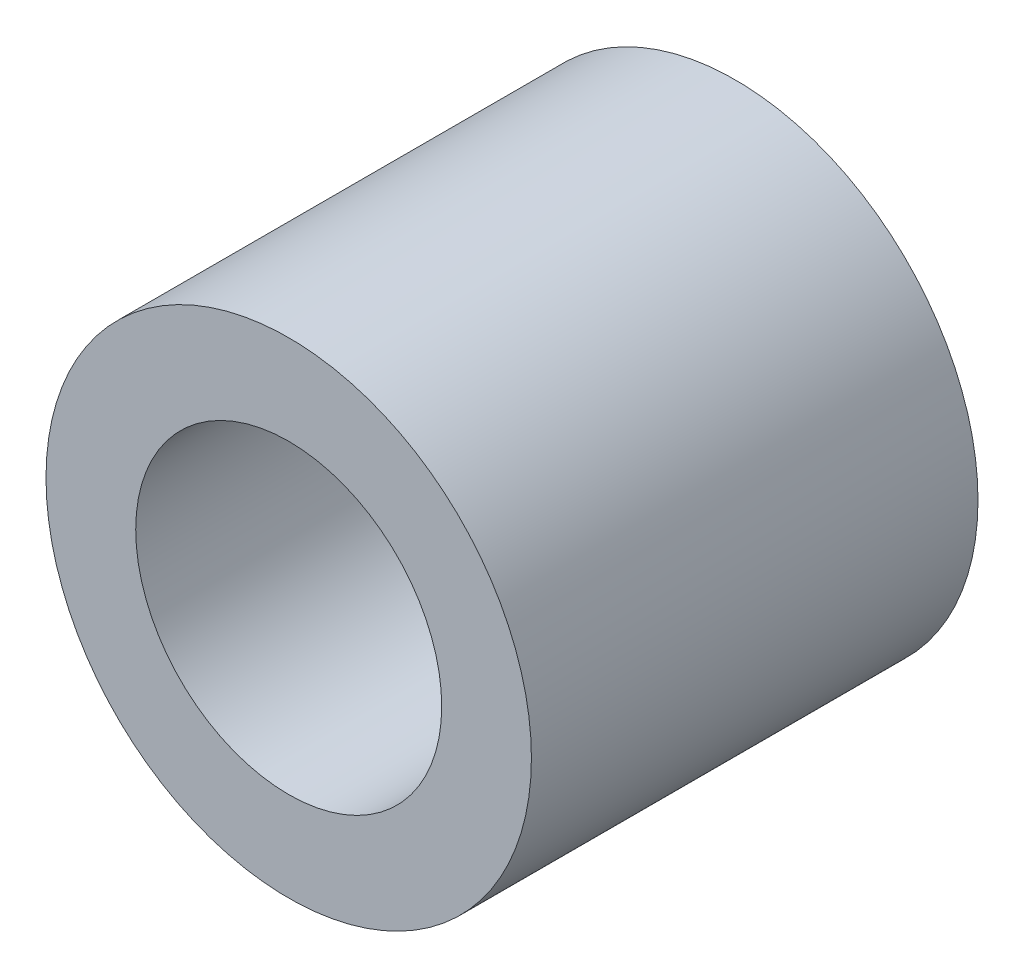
from build123d import *

# Parameters (mm, degrees)
SKETCH1_R           = 7.9375
SKETCH1_R_2         = 5.0038
BOSS_EXTRUDE1_DEPTH = 14.605


with BuildPart() as part:
    # Sketch1 → Boss-Extrude1 (new body)
    with BuildSketch(Plane.XY):
        with Locations(Location((0, 0, 0), (0, 0, 180))):
            Circle(SKETCH1_R)
        with Locations(Location((0, 0, 0), (0, 0, 180))):
            Circle(SKETCH1_R_2, mode=Mode.SUBTRACT)
    extrude(amount=BOSS_EXTRUDE1_DEPTH)


solid = part.part
